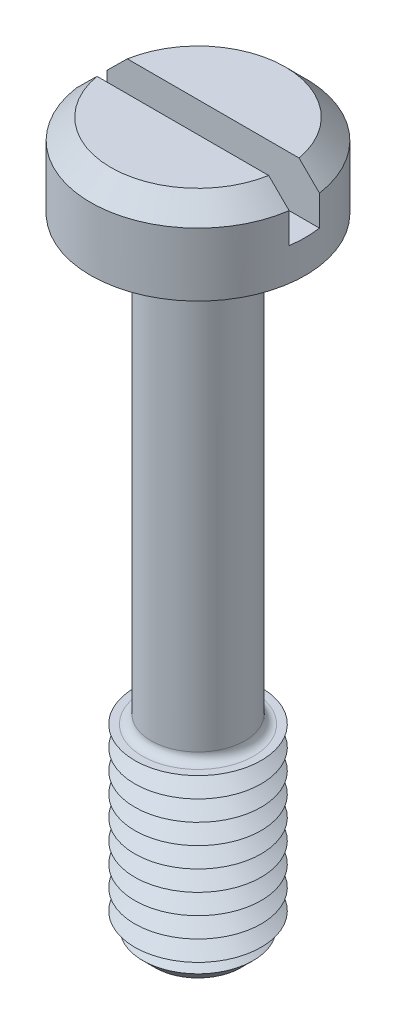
from build123d import *

# Parameters (mm, degrees)
SKETCH1_R           = 4.25
BOSS_EXTRUDE1_DEPTH = 3.3
SKETCH2_R           = 1.85
BOSS_EXTRUDE2_DEPTH = 25
SKETCH3_R           = 2.5
BOSS_EXTRUDE3_DEPTH = 7.5
CHAMFER1_SIZE       = 0.8
LPATTERN1_COUNT     = 9
LPATTERN1_PITCH     = 0.8
FILLET1_R           = 0.35
CHAMFER2_SIZE       = 0.8
SKETCH6_W           = 8.5
SKETCH6_H           = 1.2
CUT_EXTRUDE1_DEPTH  = 2


with BuildPart() as part:
    # Sketch1 → Boss-Extrude1 (new body)
    with BuildSketch(Plane(origin=(0, 0, 0), x_dir=(1, 0, 0), z_dir=(0, 1, 0))):
        with Locations(Location((0, 0, 0), (0, 0, 270))):
            Circle(SKETCH1_R)
    extrude(amount=BOSS_EXTRUDE1_DEPTH)

    # Sketch2 → Boss-Extrude2 (add)
    with BuildSketch(Plane.XZ):
        with Locations(Location((0, 0, 0), (0, 0, 270))):
            Circle(SKETCH2_R)
    extrude(amount=BOSS_EXTRUDE2_DEPTH)

    # Sketch3 → Boss-Extrude3 (add)
    with BuildSketch(Plane.XZ.offset(25)):
        with Locations(Location((0, 0, 0), (0, 0, 270))):
            Circle(SKETCH3_R)
    extrude(amount=-BOSS_EXTRUDE3_DEPTH)

    # Chamfer1
    chamfer1_edges = [part.edges().sort_by_distance(p)[0] for p in [
        (0, -25, 2.5),
    ]]
    chamfer(chamfer1_edges, length=CHAMFER1_SIZE)

    # Sketch5 → Cut-Revolve1 (revolve, cut)
    with BuildSketch(Plane(origin=(0, 0, 0), x_dir=(0, 0, -1), z_dir=(1, 0, 0))):
        Polygon((-2.5, -17.5), (-1.807179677, -17.9), (-2.5, -18.3), align=None)
    cut_revolve1 = revolve(axis=Axis((0, -6.58711856, 0), (0, -1, 0)), mode=Mode.SUBTRACT)

    # LPattern1: Cut-Revolve1 ×9
    with Locations(*[(0, -i * LPATTERN1_PITCH, 0) for i in range(1, LPATTERN1_COUNT)]):
        add(cut_revolve1, mode=Mode.SUBTRACT)

    # Fillet1
    fillet1_edges = [part.edges().sort_by_distance(p)[0] for p in [
        (0, 0, 1.85),
        (0, -17.5, 1.85),
    ]]
    fillet(fillet1_edges, radius=FILLET1_R)

    # Chamfer2
    chamfer2_edges = [part.edges().sort_by_distance(p)[0] for p in [
        (0, 3.3, -4.25),
    ]]
    chamfer(chamfer2_edges, length=CHAMFER2_SIZE)

    # Sketch6 → Cut-Extrude1 (cut)
    with BuildSketch(Plane(origin=(0, 3.3, 0), x_dir=(1, 0, 0), z_dir=(0, 1, 0))):
        Rectangle(SKETCH6_W, SKETCH6_H)
    extrude(amount=-CUT_EXTRUDE1_DEPTH, mode=Mode.SUBTRACT)


solid = part.part
